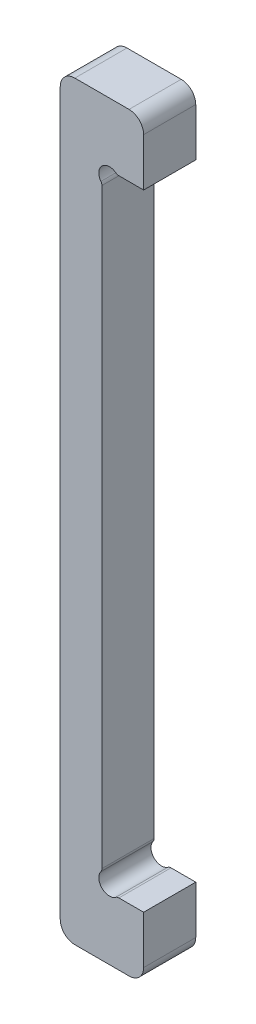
ISO-10303-21;
HEADER;
FILE_DESCRIPTION(('STEP AP214'),'2;1');
FILE_NAME('part.step','',(''),(''),'','','');
FILE_SCHEMA(('AUTOMOTIVE_DESIGN { 1 0 10303 214 1 1 1 1 }'));
ENDSEC;
DATA;
#1=APPLICATION_CONTEXT('core data for automotive mechanical design processes');
#2=APPLICATION_PROTOCOL_DEFINITION('international standard','automotive_design',2000,#1);
#3=PRODUCT_CONTEXT('',#1,'mechanical');
#4=PRODUCT('Part','Part','',(#3));
#5=PRODUCT_RELATED_PRODUCT_CATEGORY('part','',(#4));
#6=PRODUCT_DEFINITION_FORMATION('','',#4);
#7=PRODUCT_DEFINITION_CONTEXT('part definition',#1,'design');
#8=PRODUCT_DEFINITION('design','',#6,#7);
#9=PRODUCT_DEFINITION_SHAPE('','',#8);
#10=(LENGTH_UNIT() NAMED_UNIT(*) SI_UNIT(.MILLI.,.METRE.));
#11=(NAMED_UNIT(*) PLANE_ANGLE_UNIT() SI_UNIT($,.RADIAN.));
#12=(NAMED_UNIT(*) SI_UNIT($,.STERADIAN.) SOLID_ANGLE_UNIT());
#13=UNCERTAINTY_MEASURE_WITH_UNIT(LENGTH_MEASURE(1.E-05),#10,'distance_accuracy_value','');
#14=(GEOMETRIC_REPRESENTATION_CONTEXT(3) GLOBAL_UNCERTAINTY_ASSIGNED_CONTEXT((#13)) GLOBAL_UNIT_ASSIGNED_CONTEXT((#10,
#11,#12)) REPRESENTATION_CONTEXT('',''));
#15=CARTESIAN_POINT('',(0.,0.,0.));
#16=DIRECTION('',(0.,0.,1.));
#17=DIRECTION('',(1.,0.,0.));
#18=AXIS2_PLACEMENT_3D('',#15,#16,#17);
#19=CARTESIAN_POINT('',(28.1310403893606,152.5,25.));
#20=DIRECTION('',(0.,0.,-1.));
#21=DIRECTION('',(-1.,0.,0.));
#22=AXIS2_PLACEMENT_3D('',#19,#20,#21);
#23=CYLINDRICAL_SURFACE('',#22,2.49999999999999);
#24=CARTESIAN_POINT('',(28.1310403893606,152.5,0.));
#25=DIRECTION('',(0.,0.,1.));
#26=DIRECTION('',(1.,0.,0.));
#27=AXIS2_PLACEMENT_3D('',#24,#25,#26);
#28=CIRCLE('',#27,2.49999999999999);
#29=CARTESIAN_POINT('',(26.6426207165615,150.491366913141,0.));
#30=VERTEX_POINT('',#29);
#31=CARTESIAN_POINT('',(28.1310403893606,150.,0.));
#32=VERTEX_POINT('',#31);
#33=EDGE_CURVE('E239',#30,#32,#28,.T.);
#34=ORIENTED_EDGE('',*,*,#33,.T.);
#35=DIRECTION('',(0.,0.,-1.));
#36=VECTOR('',#35,1.);
#37=CARTESIAN_POINT('',(28.1310403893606,150.,25.));
#38=LINE('',#37,#36);
#39=CARTESIAN_POINT('',(28.1310403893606,150.,25.));
#40=VERTEX_POINT('',#39);
#41=EDGE_CURVE('E286',#40,#32,#38,.T.);
#42=ORIENTED_EDGE('',*,*,#41,.F.);
#43=CARTESIAN_POINT('',(28.1310403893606,152.5,25.));
#44=DIRECTION('',(0.,0.,1.));
#45=DIRECTION('',(1.,0.,0.));
#46=AXIS2_PLACEMENT_3D('',#43,#44,#45);
#47=CIRCLE('',#46,2.49999999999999);
#48=CARTESIAN_POINT('',(26.6426207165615,150.491366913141,25.));
#49=VERTEX_POINT('',#48);
#50=EDGE_CURVE('E240',#49,#40,#47,.T.);
#51=ORIENTED_EDGE('',*,*,#50,.F.);
#52=DIRECTION('',(0.,0.,-1.));
#53=VECTOR('',#52,1.);
#54=CARTESIAN_POINT('',(26.6426207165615,150.491366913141,25.));
#55=LINE('',#54,#53);
#56=EDGE_CURVE('E258',#49,#30,#55,.T.);
#57=ORIENTED_EDGE('',*,*,#56,.T.);
#58=EDGE_LOOP('',(#34,#42,#51,#57));
#59=FACE_BOUND('',#58,.T.);
#60=ADVANCED_FACE('F33',(#59),#23,.T.);
#61=CARTESIAN_POINT('',(40.,150.,25.));
#62=DIRECTION('',(0.,1.,0.));
#63=DIRECTION('',(0.,0.,1.));
#64=AXIS2_PLACEMENT_3D('',#61,#62,#63);
#65=PLANE('',#64);
#66=DIRECTION('',(1.,0.,0.));
#67=VECTOR('',#66,1.);
#68=CARTESIAN_POINT('',(40.,150.,0.));
#69=LINE('',#68,#67);
#70=CARTESIAN_POINT('',(40.,150.,0.));
#71=VERTEX_POINT('',#70);
#72=EDGE_CURVE('E261',#32,#71,#69,.T.);
#73=ORIENTED_EDGE('',*,*,#72,.T.);
#74=DIRECTION('',(0.,0.,-1.));
#75=VECTOR('',#74,1.);
#76=CARTESIAN_POINT('',(40.,150.,25.));
#77=LINE('',#76,#75);
#78=CARTESIAN_POINT('',(40.,150.,25.));
#79=VERTEX_POINT('',#78);
#80=EDGE_CURVE('E283',#79,#71,#77,.T.);
#81=ORIENTED_EDGE('',*,*,#80,.F.);
#82=DIRECTION('',(1.,0.,0.));
#83=VECTOR('',#82,1.);
#84=CARTESIAN_POINT('',(40.,150.,25.));
#85=LINE('',#84,#83);
#86=EDGE_CURVE('E243',#40,#79,#85,.T.);
#87=ORIENTED_EDGE('',*,*,#86,.F.);
#88=ORIENTED_EDGE('',*,*,#41,.T.);
#89=EDGE_LOOP('',(#73,#81,#87,#88));
#90=FACE_BOUND('',#89,.T.);
#91=ADVANCED_FACE('F314',(#90),#65,.F.);
#92=CARTESIAN_POINT('',(40.,180.,25.));
#93=DIRECTION('',(-1.,0.,0.));
#94=DIRECTION('',(0.,-1.,0.));
#95=AXIS2_PLACEMENT_3D('',#92,#93,#94);
#96=PLANE('',#95);
#97=DIRECTION('',(0.,1.,0.));
#98=VECTOR('',#97,1.);
#99=CARTESIAN_POINT('',(40.,180.,0.));
#100=LINE('',#99,#98);
#101=CARTESIAN_POINT('',(40.,173.,0.));
#102=VERTEX_POINT('',#101);
#103=EDGE_CURVE('E263',#71,#102,#100,.T.);
#104=ORIENTED_EDGE('',*,*,#103,.T.);
#105=DIRECTION('',(0.,0.,-1.));
#106=VECTOR('',#105,1.);
#107=CARTESIAN_POINT('',(40.,173.,25.));
#108=LINE('',#107,#106);
#109=CARTESIAN_POINT('',(40.,173.,25.));
#110=VERTEX_POINT('',#109);
#111=EDGE_CURVE('E56',#102,#110,#108,.F.);
#112=ORIENTED_EDGE('',*,*,#111,.T.);
#113=DIRECTION('',(0.,1.,0.));
#114=VECTOR('',#113,1.);
#115=CARTESIAN_POINT('',(40.,180.,25.));
#116=LINE('',#115,#114);
#117=EDGE_CURVE('E246',#79,#110,#116,.T.);
#118=ORIENTED_EDGE('',*,*,#117,.F.);
#119=ORIENTED_EDGE('',*,*,#80,.T.);
#120=EDGE_LOOP('',(#104,#112,#118,#119));
#121=FACE_BOUND('',#120,.T.);
#122=ADVANCED_FACE('F311',(#121),#96,.F.);
#123=CARTESIAN_POINT('',(40.,180.,25.));
#124=DIRECTION('',(0.,-1.,0.));
#125=DIRECTION('',(0.,0.,-1.));
#126=AXIS2_PLACEMENT_3D('',#123,#124,#125);
#127=PLANE('',#126);
#128=DIRECTION('',(-1.,0.,0.));
#129=VECTOR('',#128,1.);
#130=CARTESIAN_POINT('',(40.,180.,25.));
#131=LINE('',#130,#129);
#132=CARTESIAN_POINT('',(33.,180.,25.));
#133=VERTEX_POINT('',#132);
#134=CARTESIAN_POINT('',(7.,180.,25.));
#135=VERTEX_POINT('',#134);
#136=EDGE_CURVE('E248',#133,#135,#131,.T.);
#137=ORIENTED_EDGE('',*,*,#136,.F.);
#138=DIRECTION('',(0.,0.,-1.));
#139=VECTOR('',#138,1.);
#140=CARTESIAN_POINT('',(33.,180.,25.));
#141=LINE('',#140,#139);
#142=CARTESIAN_POINT('',(33.,180.,0.));
#143=VERTEX_POINT('',#142);
#144=EDGE_CURVE('E291',#133,#143,#141,.T.);
#145=ORIENTED_EDGE('',*,*,#144,.T.);
#146=DIRECTION('',(-1.,0.,0.));
#147=VECTOR('',#146,1.);
#148=CARTESIAN_POINT('',(40.,180.,0.));
#149=LINE('',#148,#147);
#150=CARTESIAN_POINT('',(7.,180.,0.));
#151=VERTEX_POINT('',#150);
#152=EDGE_CURVE('E265',#143,#151,#149,.T.);
#153=ORIENTED_EDGE('',*,*,#152,.T.);
#154=DIRECTION('',(0.,0.,-1.));
#155=VECTOR('',#154,1.);
#156=CARTESIAN_POINT('',(7.,180.,25.));
#157=LINE('',#156,#155);
#158=EDGE_CURVE('E289',#151,#135,#157,.F.);
#159=ORIENTED_EDGE('',*,*,#158,.T.);
#160=EDGE_LOOP('',(#137,#145,#153,#159));
#161=FACE_BOUND('',#160,.T.);
#162=ADVANCED_FACE('F304',(#161),#127,.F.);
#163=CARTESIAN_POINT('',(0.,180.,25.));
#164=DIRECTION('',(1.,0.,0.));
#165=DIRECTION('',(0.,1.,0.));
#166=AXIS2_PLACEMENT_3D('',#163,#164,#165);
#167=PLANE('',#166);
#168=DIRECTION('',(0.,-1.,0.));
#169=VECTOR('',#168,1.);
#170=CARTESIAN_POINT('',(0.,180.,25.));
#171=LINE('',#170,#169);
#172=CARTESIAN_POINT('',(0.,173.,25.));
#173=VERTEX_POINT('',#172);
#174=CARTESIAN_POINT('',(0.,-173.,25.));
#175=VERTEX_POINT('',#174);
#176=EDGE_CURVE('E250',#173,#175,#171,.T.);
#177=ORIENTED_EDGE('',*,*,#176,.F.);
#178=DIRECTION('',(0.,0.,-1.));
#179=VECTOR('',#178,1.);
#180=CARTESIAN_POINT('',(0.,173.,25.));
#181=LINE('',#180,#179);
#182=CARTESIAN_POINT('',(0.,173.,0.));
#183=VERTEX_POINT('',#182);
#184=EDGE_CURVE('E11',#173,#183,#181,.T.);
#185=ORIENTED_EDGE('',*,*,#184,.T.);
#186=DIRECTION('',(0.,-1.,0.));
#187=VECTOR('',#186,1.);
#188=CARTESIAN_POINT('',(0.,180.,0.));
#189=LINE('',#188,#187);
#190=CARTESIAN_POINT('',(0.,-173.,0.));
#191=VERTEX_POINT('',#190);
#192=EDGE_CURVE('E268',#183,#191,#189,.T.);
#193=ORIENTED_EDGE('',*,*,#192,.T.);
#194=DIRECTION('',(0.,0.,-1.));
#195=VECTOR('',#194,1.);
#196=CARTESIAN_POINT('',(0.,-173.,25.));
#197=LINE('',#196,#195);
#198=EDGE_CURVE('E236',#175,#191,#197,.T.);
#199=ORIENTED_EDGE('',*,*,#198,.F.);
#200=EDGE_LOOP('',(#177,#185,#193,#199));
#201=FACE_BOUND('',#200,.T.);
#202=ADVANCED_FACE('F357',(#201),#167,.F.);
#203=CARTESIAN_POINT('',(20.,141.86895961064,25.));
#204=DIRECTION('',(-1.,0.,0.));
#205=DIRECTION('',(0.,-1.,0.));
#206=AXIS2_PLACEMENT_3D('',#203,#204,#205);
#207=PLANE('',#206);
#208=DIRECTION('',(0.,1.,0.));
#209=VECTOR('',#208,1.);
#210=CARTESIAN_POINT('',(20.,141.86895961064,0.));
#211=LINE('',#210,#209);
#212=CARTESIAN_POINT('',(20.,-141.86895961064,0.));
#213=VERTEX_POINT('',#212);
#214=CARTESIAN_POINT('',(20.,141.86895961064,0.));
#215=VERTEX_POINT('',#214);
#216=EDGE_CURVE('E270',#213,#215,#211,.T.);
#217=ORIENTED_EDGE('',*,*,#216,.T.);
#218=DIRECTION('',(0.,0.,-1.));
#219=VECTOR('',#218,1.);
#220=CARTESIAN_POINT('',(20.,141.86895961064,25.));
#221=LINE('',#220,#219);
#222=CARTESIAN_POINT('',(20.,141.86895961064,25.));
#223=VERTEX_POINT('',#222);
#224=EDGE_CURVE('E280',#223,#215,#221,.T.);
#225=ORIENTED_EDGE('',*,*,#224,.F.);
#226=DIRECTION('',(0.,1.,0.));
#227=VECTOR('',#226,1.);
#228=CARTESIAN_POINT('',(20.,141.86895961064,25.));
#229=LINE('',#228,#227);
#230=CARTESIAN_POINT('',(20.,-141.86895961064,25.));
#231=VERTEX_POINT('',#230);
#232=EDGE_CURVE('E252',#231,#223,#229,.T.);
#233=ORIENTED_EDGE('',*,*,#232,.F.);
#234=DIRECTION('',(0.,0.,-1.));
#235=VECTOR('',#234,1.);
#236=CARTESIAN_POINT('',(20.,-141.86895961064,25.));
#237=LINE('',#236,#235);
#238=EDGE_CURVE('E215',#231,#213,#237,.T.);
#239=ORIENTED_EDGE('',*,*,#238,.T.);
#240=EDGE_LOOP('',(#217,#225,#233,#239));
#241=FACE_BOUND('',#240,.T.);
#242=ADVANCED_FACE('F336',(#241),#207,.F.);
#243=CARTESIAN_POINT('',(17.5,141.86895961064,25.));
#244=DIRECTION('',(0.,0.,-1.));
#245=DIRECTION('',(-1.,0.,0.));
#246=AXIS2_PLACEMENT_3D('',#243,#244,#245);
#247=CYLINDRICAL_SURFACE('',#246,2.5);
#248=CARTESIAN_POINT('',(17.5,141.86895961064,0.));
#249=DIRECTION('',(0.,0.,1.));
#250=DIRECTION('',(-1.,0.,0.));
#251=AXIS2_PLACEMENT_3D('',#248,#249,#250);
#252=CIRCLE('',#251,2.5);
#253=CARTESIAN_POINT('',(19.508633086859,143.357379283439,0.));
#254=VERTEX_POINT('',#253);
#255=EDGE_CURVE('E272',#215,#254,#252,.T.);
#256=ORIENTED_EDGE('',*,*,#255,.T.);
#257=DIRECTION('',(0.,0.,-1.));
#258=VECTOR('',#257,1.);
#259=CARTESIAN_POINT('',(19.508633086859,143.357379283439,25.));
#260=LINE('',#259,#258);
#261=CARTESIAN_POINT('',(19.508633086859,143.357379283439,25.));
#262=VERTEX_POINT('',#261);
#263=EDGE_CURVE('E277',#262,#254,#260,.T.);
#264=ORIENTED_EDGE('',*,*,#263,.F.);
#265=CARTESIAN_POINT('',(17.5,141.86895961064,25.));
#266=DIRECTION('',(0.,0.,1.));
#267=DIRECTION('',(-1.,0.,0.));
#268=AXIS2_PLACEMENT_3D('',#265,#266,#267);
#269=CIRCLE('',#268,2.5);
#270=EDGE_CURVE('E254',#223,#262,#269,.T.);
#271=ORIENTED_EDGE('',*,*,#270,.F.);
#272=ORIENTED_EDGE('',*,*,#224,.T.);
#273=EDGE_LOOP('',(#256,#264,#271,#272));
#274=FACE_BOUND('',#273,.T.);
#275=ADVANCED_FACE('F328',(#274),#247,.T.);
#276=CARTESIAN_POINT('',(23.6062445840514,146.393755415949,25.));
#277=DIRECTION('',(0.,0.,-1.));
#278=DIRECTION('',(-1.,0.,0.));
#279=AXIS2_PLACEMENT_3D('',#276,#277,#278);
#280=CYLINDRICAL_SURFACE('',#279,5.09999999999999);
#281=CARTESIAN_POINT('',(23.6062445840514,146.393755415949,0.));
#282=DIRECTION('',(0.,0.,-1.));
#283=DIRECTION('',(1.,0.,0.));
#284=AXIS2_PLACEMENT_3D('',#281,#282,#283);
#285=CIRCLE('',#284,5.09999999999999);
#286=EDGE_CURVE('E244',#254,#30,#285,.T.);
#287=ORIENTED_EDGE('',*,*,#286,.T.);
#288=ORIENTED_EDGE('',*,*,#56,.F.);
#289=CARTESIAN_POINT('',(23.6062445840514,146.393755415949,25.));
#290=DIRECTION('',(0.,0.,-1.));
#291=DIRECTION('',(1.,0.,0.));
#292=AXIS2_PLACEMENT_3D('',#289,#290,#291);
#293=CIRCLE('',#292,5.09999999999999);
#294=EDGE_CURVE('E256',#262,#49,#293,.T.);
#295=ORIENTED_EDGE('',*,*,#294,.F.);
#296=ORIENTED_EDGE('',*,*,#263,.T.);
#297=EDGE_LOOP('',(#287,#288,#295,#296));
#298=FACE_BOUND('',#297,.T.);
#299=ADVANCED_FACE('F324',(#298),#280,.F.);
#300=CARTESIAN_POINT('',(28.1310403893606,152.5,25.));
#301=DIRECTION('',(0.,0.,1.));
#302=DIRECTION('',(1.,0.,0.));
#303=AXIS2_PLACEMENT_3D('',#300,#301,#302);
#304=PLANE('',#303);
#305=ORIENTED_EDGE('',*,*,#117,.T.);
#306=CARTESIAN_POINT('',(33.,173.,25.));
#307=DIRECTION('',(0.,0.,1.));
#308=DIRECTION('',(1.,0.,0.));
#309=AXIS2_PLACEMENT_3D('',#306,#307,#308);
#310=CIRCLE('',#309,7.);
#311=EDGE_CURVE('E41',#110,#133,#310,.T.);
#312=ORIENTED_EDGE('',*,*,#311,.T.);
#313=ORIENTED_EDGE('',*,*,#136,.T.);
#314=CARTESIAN_POINT('',(7.,173.,25.));
#315=DIRECTION('',(0.,0.,1.));
#316=DIRECTION('',(1.,0.,0.));
#317=AXIS2_PLACEMENT_3D('',#314,#315,#316);
#318=CIRCLE('',#317,7.);
#319=EDGE_CURVE('E48',#135,#173,#318,.T.);
#320=ORIENTED_EDGE('',*,*,#319,.T.);
#321=ORIENTED_EDGE('',*,*,#176,.T.);
#322=CARTESIAN_POINT('',(6.99999999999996,-173.,25.));
#323=DIRECTION('',(0.,0.,-1.));
#324=DIRECTION('',(1.,0.,0.));
#325=AXIS2_PLACEMENT_3D('',#322,#323,#324);
#326=CIRCLE('',#325,7.);
#327=CARTESIAN_POINT('',(6.99999999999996,-180.,25.));
#328=VERTEX_POINT('',#327);
#329=EDGE_CURVE('E231',#328,#175,#326,.T.);
#330=ORIENTED_EDGE('',*,*,#329,.F.);
#331=DIRECTION('',(-1.,0.,0.));
#332=VECTOR('',#331,1.);
#333=CARTESIAN_POINT('',(40.,-180.,25.));
#334=LINE('',#333,#332);
#335=CARTESIAN_POINT('',(33.,-180.,25.));
#336=VERTEX_POINT('',#335);
#337=EDGE_CURVE('E192',#336,#328,#334,.T.);
#338=ORIENTED_EDGE('',*,*,#337,.F.);
#339=CARTESIAN_POINT('',(33.,-173.,25.));
#340=DIRECTION('',(0.,0.,-1.));
#341=DIRECTION('',(1.,0.,0.));
#342=AXIS2_PLACEMENT_3D('',#339,#340,#341);
#343=CIRCLE('',#342,7.);
#344=CARTESIAN_POINT('',(40.,-173.,25.));
#345=VERTEX_POINT('',#344);
#346=EDGE_CURVE('E234',#345,#336,#343,.T.);
#347=ORIENTED_EDGE('',*,*,#346,.F.);
#348=DIRECTION('',(0.,-1.,0.));
#349=VECTOR('',#348,1.);
#350=CARTESIAN_POINT('',(40.,-180.,25.));
#351=LINE('',#350,#349);
#352=CARTESIAN_POINT('',(40.,-150.,25.));
#353=VERTEX_POINT('',#352);
#354=EDGE_CURVE('E167',#353,#345,#351,.T.);
#355=ORIENTED_EDGE('',*,*,#354,.F.);
#356=DIRECTION('',(1.,0.,0.));
#357=VECTOR('',#356,1.);
#358=CARTESIAN_POINT('',(40.,-150.,25.));
#359=LINE('',#358,#357);
#360=CARTESIAN_POINT('',(28.1310403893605,-150.,25.));
#361=VERTEX_POINT('',#360);
#362=EDGE_CURVE('E160',#361,#353,#359,.T.);
#363=ORIENTED_EDGE('',*,*,#362,.F.);
#364=CARTESIAN_POINT('',(28.1310403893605,-152.5,25.));
#365=DIRECTION('',(0.,0.,-1.));
#366=DIRECTION('',(1.,0.,0.));
#367=AXIS2_PLACEMENT_3D('',#364,#365,#366);
#368=CIRCLE('',#367,2.49999999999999);
#369=CARTESIAN_POINT('',(26.6426207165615,-150.491366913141,25.));
#370=VERTEX_POINT('',#369);
#371=EDGE_CURVE('E164',#370,#361,#368,.T.);
#372=ORIENTED_EDGE('',*,*,#371,.F.);
#373=CARTESIAN_POINT('',(23.6062445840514,-146.393755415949,25.));
#374=DIRECTION('',(0.,0.,1.));
#375=DIRECTION('',(1.,0.,0.));
#376=AXIS2_PLACEMENT_3D('',#373,#374,#375);
#377=CIRCLE('',#376,5.09999999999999);
#378=CARTESIAN_POINT('',(19.508633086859,-143.357379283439,25.));
#379=VERTEX_POINT('',#378);
#380=EDGE_CURVE('E198',#379,#370,#377,.T.);
#381=ORIENTED_EDGE('',*,*,#380,.F.);
#382=CARTESIAN_POINT('',(17.5,-141.86895961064,25.));
#383=DIRECTION('',(0.,0.,-1.));
#384=DIRECTION('',(-1.,0.,0.));
#385=AXIS2_PLACEMENT_3D('',#382,#383,#384);
#386=CIRCLE('',#385,2.5);
#387=EDGE_CURVE('E195',#231,#379,#386,.T.);
#388=ORIENTED_EDGE('',*,*,#387,.F.);
#389=ORIENTED_EDGE('',*,*,#232,.T.);
#390=ORIENTED_EDGE('',*,*,#270,.T.);
#391=ORIENTED_EDGE('',*,*,#294,.T.);
#392=ORIENTED_EDGE('',*,*,#50,.T.);
#393=ORIENTED_EDGE('',*,*,#86,.T.);
#394=EDGE_LOOP('',(#305,#312,#313,#320,#321,#330,#338,#347,#355,#363,#372,#381,#388,#389,#390,
#391,#392,#393));
#395=FACE_BOUND('',#394,.T.);
#396=ADVANCED_FACE('F162',(#395),#304,.T.);
#397=CARTESIAN_POINT('',(28.1310403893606,152.5,0.));
#398=DIRECTION('',(0.,0.,1.));
#399=DIRECTION('',(1.,0.,0.));
#400=AXIS2_PLACEMENT_3D('',#397,#398,#399);
#401=PLANE('',#400);
#402=ORIENTED_EDGE('',*,*,#152,.F.);
#403=CARTESIAN_POINT('',(33.,173.,0.));
#404=DIRECTION('',(0.,0.,1.));
#405=DIRECTION('',(1.,0.,0.));
#406=AXIS2_PLACEMENT_3D('',#403,#404,#405);
#407=CIRCLE('',#406,7.);
#408=EDGE_CURVE('E296',#143,#102,#407,.F.);
#409=ORIENTED_EDGE('',*,*,#408,.T.);
#410=ORIENTED_EDGE('',*,*,#103,.F.);
#411=ORIENTED_EDGE('',*,*,#72,.F.);
#412=ORIENTED_EDGE('',*,*,#33,.F.);
#413=ORIENTED_EDGE('',*,*,#286,.F.);
#414=ORIENTED_EDGE('',*,*,#255,.F.);
#415=ORIENTED_EDGE('',*,*,#216,.F.);
#416=CARTESIAN_POINT('',(17.5,-141.86895961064,0.));
#417=DIRECTION('',(0.,0.,-1.));
#418=DIRECTION('',(-1.,0.,0.));
#419=AXIS2_PLACEMENT_3D('',#416,#417,#418);
#420=CIRCLE('',#419,2.5);
#421=CARTESIAN_POINT('',(19.508633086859,-143.357379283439,0.));
#422=VERTEX_POINT('',#421);
#423=EDGE_CURVE('E188',#213,#422,#420,.T.);
#424=ORIENTED_EDGE('',*,*,#423,.T.);
#425=CARTESIAN_POINT('',(23.6062445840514,-146.393755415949,0.));
#426=DIRECTION('',(0.,0.,1.));
#427=DIRECTION('',(1.,0.,0.));
#428=AXIS2_PLACEMENT_3D('',#425,#426,#427);
#429=CIRCLE('',#428,5.09999999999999);
#430=CARTESIAN_POINT('',(26.6426207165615,-150.491366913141,0.));
#431=VERTEX_POINT('',#430);
#432=EDGE_CURVE('E186',#422,#431,#429,.T.);
#433=ORIENTED_EDGE('',*,*,#432,.T.);
#434=CARTESIAN_POINT('',(28.1310403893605,-152.5,0.));
#435=DIRECTION('',(0.,0.,-1.));
#436=DIRECTION('',(1.,0.,0.));
#437=AXIS2_PLACEMENT_3D('',#434,#435,#436);
#438=CIRCLE('',#437,2.49999999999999);
#439=CARTESIAN_POINT('',(28.1310403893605,-150.,0.));
#440=VERTEX_POINT('',#439);
#441=EDGE_CURVE('E200',#431,#440,#438,.T.);
#442=ORIENTED_EDGE('',*,*,#441,.T.);
#443=DIRECTION('',(1.,0.,0.));
#444=VECTOR('',#443,1.);
#445=CARTESIAN_POINT('',(40.,-150.,0.));
#446=LINE('',#445,#444);
#447=CARTESIAN_POINT('',(40.,-150.,0.));
#448=VERTEX_POINT('',#447);
#449=EDGE_CURVE('E176',#440,#448,#446,.T.);
#450=ORIENTED_EDGE('',*,*,#449,.T.);
#451=DIRECTION('',(0.,-1.,0.));
#452=VECTOR('',#451,1.);
#453=CARTESIAN_POINT('',(40.,-180.,0.));
#454=LINE('',#453,#452);
#455=CARTESIAN_POINT('',(40.,-173.,0.));
#456=VERTEX_POINT('',#455);
#457=EDGE_CURVE('E203',#448,#456,#454,.T.);
#458=ORIENTED_EDGE('',*,*,#457,.T.);
#459=CARTESIAN_POINT('',(33.,-173.,0.));
#460=DIRECTION('',(0.,0.,-1.));
#461=DIRECTION('',(1.,0.,0.));
#462=AXIS2_PLACEMENT_3D('',#459,#460,#461);
#463=CIRCLE('',#462,7.);
#464=CARTESIAN_POINT('',(33.,-180.,0.));
#465=VERTEX_POINT('',#464);
#466=EDGE_CURVE('E226',#465,#456,#463,.F.);
#467=ORIENTED_EDGE('',*,*,#466,.F.);
#468=DIRECTION('',(-1.,0.,0.));
#469=VECTOR('',#468,1.);
#470=CARTESIAN_POINT('',(40.,-180.,0.));
#471=LINE('',#470,#469);
#472=CARTESIAN_POINT('',(6.99999999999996,-180.,0.));
#473=VERTEX_POINT('',#472);
#474=EDGE_CURVE('E206',#465,#473,#471,.T.);
#475=ORIENTED_EDGE('',*,*,#474,.T.);
#476=CARTESIAN_POINT('',(6.99999999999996,-173.,0.));
#477=DIRECTION('',(0.,0.,-1.));
#478=DIRECTION('',(1.,0.,0.));
#479=AXIS2_PLACEMENT_3D('',#476,#477,#478);
#480=CIRCLE('',#479,7.);
#481=EDGE_CURVE('E224',#191,#473,#480,.F.);
#482=ORIENTED_EDGE('',*,*,#481,.F.);
#483=ORIENTED_EDGE('',*,*,#192,.F.);
#484=CARTESIAN_POINT('',(7.,173.,0.));
#485=DIRECTION('',(0.,0.,1.));
#486=DIRECTION('',(1.,0.,0.));
#487=AXIS2_PLACEMENT_3D('',#484,#485,#486);
#488=CIRCLE('',#487,7.);
#489=EDGE_CURVE('E294',#183,#151,#488,.F.);
#490=ORIENTED_EDGE('',*,*,#489,.T.);
#491=EDGE_LOOP('',(#402,#409,#410,#411,#412,#413,#414,#415,#424,#433,#442,#450,#458,#467,#475,
#482,#483,#490));
#492=FACE_BOUND('',#491,.T.);
#493=ADVANCED_FACE('F310',(#492),#401,.F.);
#494=CARTESIAN_POINT('',(33.,173.,25.));
#495=DIRECTION('',(0.,0.,-1.));
#496=DIRECTION('',(-1.,0.,0.));
#497=AXIS2_PLACEMENT_3D('',#494,#495,#496);
#498=CYLINDRICAL_SURFACE('',#497,7.);
#499=ORIENTED_EDGE('',*,*,#311,.F.);
#500=ORIENTED_EDGE('',*,*,#111,.F.);
#501=ORIENTED_EDGE('',*,*,#408,.F.);
#502=ORIENTED_EDGE('',*,*,#144,.F.);
#503=EDGE_LOOP('',(#499,#500,#501,#502));
#504=FACE_BOUND('',#503,.T.);
#505=ADVANCED_FACE('F307',(#504),#498,.T.);
#506=CARTESIAN_POINT('',(7.,173.,25.));
#507=DIRECTION('',(0.,0.,-1.));
#508=DIRECTION('',(-1.,0.,0.));
#509=AXIS2_PLACEMENT_3D('',#506,#507,#508);
#510=CYLINDRICAL_SURFACE('',#509,7.);
#511=ORIENTED_EDGE('',*,*,#319,.F.);
#512=ORIENTED_EDGE('',*,*,#158,.F.);
#513=ORIENTED_EDGE('',*,*,#489,.F.);
#514=ORIENTED_EDGE('',*,*,#184,.F.);
#515=EDGE_LOOP('',(#511,#512,#513,#514));
#516=FACE_BOUND('',#515,.T.);
#517=ADVANCED_FACE('F35',(#516),#510,.T.);
#518=CARTESIAN_POINT('',(28.1310403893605,-152.5,25.));
#519=DIRECTION('',(0.,0.,-1.));
#520=DIRECTION('',(-1.,0.,0.));
#521=AXIS2_PLACEMENT_3D('',#518,#519,#520);
#522=CYLINDRICAL_SURFACE('',#521,2.49999999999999);
#523=ORIENTED_EDGE('',*,*,#441,.F.);
#524=DIRECTION('',(0.,0.,-1.));
#525=VECTOR('',#524,1.);
#526=CARTESIAN_POINT('',(26.6426207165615,-150.491366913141,25.));
#527=LINE('',#526,#525);
#528=EDGE_CURVE('E185',#370,#431,#527,.T.);
#529=ORIENTED_EDGE('',*,*,#528,.F.);
#530=ORIENTED_EDGE('',*,*,#371,.T.);
#531=DIRECTION('',(0.,0.,-1.));
#532=VECTOR('',#531,1.);
#533=CARTESIAN_POINT('',(28.1310403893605,-150.,25.));
#534=LINE('',#533,#532);
#535=EDGE_CURVE('E173',#361,#440,#534,.T.);
#536=ORIENTED_EDGE('',*,*,#535,.T.);
#537=EDGE_LOOP('',(#523,#529,#530,#536));
#538=FACE_BOUND('',#537,.T.);
#539=ADVANCED_FACE('F183',(#538),#522,.T.);
#540=CARTESIAN_POINT('',(40.,-150.,25.));
#541=DIRECTION('',(0.,-1.,0.));
#542=DIRECTION('',(0.,0.,1.));
#543=AXIS2_PLACEMENT_3D('',#540,#541,#542);
#544=PLANE('',#543);
#545=ORIENTED_EDGE('',*,*,#449,.F.);
#546=ORIENTED_EDGE('',*,*,#535,.F.);
#547=ORIENTED_EDGE('',*,*,#362,.T.);
#548=DIRECTION('',(0.,0.,-1.));
#549=VECTOR('',#548,1.);
#550=CARTESIAN_POINT('',(40.,-150.,25.));
#551=LINE('',#550,#549);
#552=EDGE_CURVE('E181',#353,#448,#551,.T.);
#553=ORIENTED_EDGE('',*,*,#552,.T.);
#554=EDGE_LOOP('',(#545,#546,#547,#553));
#555=FACE_BOUND('',#554,.T.);
#556=ADVANCED_FACE('F174',(#555),#544,.F.);
#557=CARTESIAN_POINT('',(40.,-180.,25.));
#558=DIRECTION('',(-1.,0.,0.));
#559=DIRECTION('',(0.,1.,0.));
#560=AXIS2_PLACEMENT_3D('',#557,#558,#559);
#561=PLANE('',#560);
#562=ORIENTED_EDGE('',*,*,#457,.F.);
#563=ORIENTED_EDGE('',*,*,#552,.F.);
#564=ORIENTED_EDGE('',*,*,#354,.T.);
#565=DIRECTION('',(0.,0.,-1.));
#566=VECTOR('',#565,1.);
#567=CARTESIAN_POINT('',(40.,-173.,25.));
#568=LINE('',#567,#566);
#569=EDGE_CURVE('E228',#456,#345,#568,.F.);
#570=ORIENTED_EDGE('',*,*,#569,.F.);
#571=EDGE_LOOP('',(#562,#563,#564,#570));
#572=FACE_BOUND('',#571,.T.);
#573=ADVANCED_FACE('F342',(#572),#561,.F.);
#574=CARTESIAN_POINT('',(40.,-180.,25.));
#575=DIRECTION('',(0.,1.,0.));
#576=DIRECTION('',(0.,0.,-1.));
#577=AXIS2_PLACEMENT_3D('',#574,#575,#576);
#578=PLANE('',#577);
#579=ORIENTED_EDGE('',*,*,#337,.T.);
#580=DIRECTION('',(0.,0.,-1.));
#581=VECTOR('',#580,1.);
#582=CARTESIAN_POINT('',(6.99999999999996,-180.,25.));
#583=LINE('',#582,#581);
#584=EDGE_CURVE('E180',#473,#328,#583,.F.);
#585=ORIENTED_EDGE('',*,*,#584,.F.);
#586=ORIENTED_EDGE('',*,*,#474,.F.);
#587=DIRECTION('',(0.,0.,-1.));
#588=VECTOR('',#587,1.);
#589=CARTESIAN_POINT('',(33.,-180.,25.));
#590=LINE('',#589,#588);
#591=EDGE_CURVE('E221',#336,#465,#590,.T.);
#592=ORIENTED_EDGE('',*,*,#591,.F.);
#593=EDGE_LOOP('',(#579,#585,#586,#592));
#594=FACE_BOUND('',#593,.T.);
#595=ADVANCED_FACE('F350',(#594),#578,.F.);
#596=CARTESIAN_POINT('',(17.5,-141.86895961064,25.));
#597=DIRECTION('',(0.,0.,-1.));
#598=DIRECTION('',(-1.,0.,0.));
#599=AXIS2_PLACEMENT_3D('',#596,#597,#598);
#600=CYLINDRICAL_SURFACE('',#599,2.5);
#601=ORIENTED_EDGE('',*,*,#423,.F.);
#602=ORIENTED_EDGE('',*,*,#238,.F.);
#603=ORIENTED_EDGE('',*,*,#387,.T.);
#604=DIRECTION('',(0.,0.,-1.));
#605=VECTOR('',#604,1.);
#606=CARTESIAN_POINT('',(19.508633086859,-143.357379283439,25.));
#607=LINE('',#606,#605);
#608=EDGE_CURVE('E212',#379,#422,#607,.T.);
#609=ORIENTED_EDGE('',*,*,#608,.T.);
#610=EDGE_LOOP('',(#601,#602,#603,#609));
#611=FACE_BOUND('',#610,.T.);
#612=ADVANCED_FACE('F334',(#611),#600,.T.);
#613=CARTESIAN_POINT('',(23.6062445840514,-146.393755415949,25.));
#614=DIRECTION('',(0.,0.,-1.));
#615=DIRECTION('',(-1.,0.,0.));
#616=AXIS2_PLACEMENT_3D('',#613,#614,#615);
#617=CYLINDRICAL_SURFACE('',#616,5.09999999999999);
#618=ORIENTED_EDGE('',*,*,#432,.F.);
#619=ORIENTED_EDGE('',*,*,#608,.F.);
#620=ORIENTED_EDGE('',*,*,#380,.T.);
#621=ORIENTED_EDGE('',*,*,#528,.T.);
#622=EDGE_LOOP('',(#618,#619,#620,#621));
#623=FACE_BOUND('',#622,.T.);
#624=ADVANCED_FACE('F339',(#623),#617,.F.);
#625=CARTESIAN_POINT('',(33.,-173.,25.));
#626=DIRECTION('',(0.,0.,-1.));
#627=DIRECTION('',(-1.,0.,0.));
#628=AXIS2_PLACEMENT_3D('',#625,#626,#627);
#629=CYLINDRICAL_SURFACE('',#628,7.);
#630=ORIENTED_EDGE('',*,*,#346,.T.);
#631=ORIENTED_EDGE('',*,*,#591,.T.);
#632=ORIENTED_EDGE('',*,*,#466,.T.);
#633=ORIENTED_EDGE('',*,*,#569,.T.);
#634=EDGE_LOOP('',(#630,#631,#632,#633));
#635=FACE_BOUND('',#634,.T.);
#636=ADVANCED_FACE('F344',(#635),#629,.T.);
#637=CARTESIAN_POINT('',(6.99999999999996,-173.,25.));
#638=DIRECTION('',(0.,0.,-1.));
#639=DIRECTION('',(-1.,0.,0.));
#640=AXIS2_PLACEMENT_3D('',#637,#638,#639);
#641=CYLINDRICAL_SURFACE('',#640,7.);
#642=ORIENTED_EDGE('',*,*,#329,.T.);
#643=ORIENTED_EDGE('',*,*,#198,.T.);
#644=ORIENTED_EDGE('',*,*,#481,.T.);
#645=ORIENTED_EDGE('',*,*,#584,.T.);
#646=EDGE_LOOP('',(#642,#643,#644,#645));
#647=FACE_BOUND('',#646,.T.);
#648=ADVANCED_FACE('F355',(#647),#641,.T.);
#649=CLOSED_SHELL('',(#60,#91,#122,#162,#202,#242,#275,#299,#396,#493,#505,#517,#539,#556,#573,
#595,#612,#624,#636,#648));
#650=MANIFOLD_SOLID_BREP('B2',#649);
#651=ADVANCED_BREP_SHAPE_REPRESENTATION('',(#18,#650),#14);
#652=SHAPE_DEFINITION_REPRESENTATION(#9,#651);
ENDSEC;
END-ISO-10303-21;
